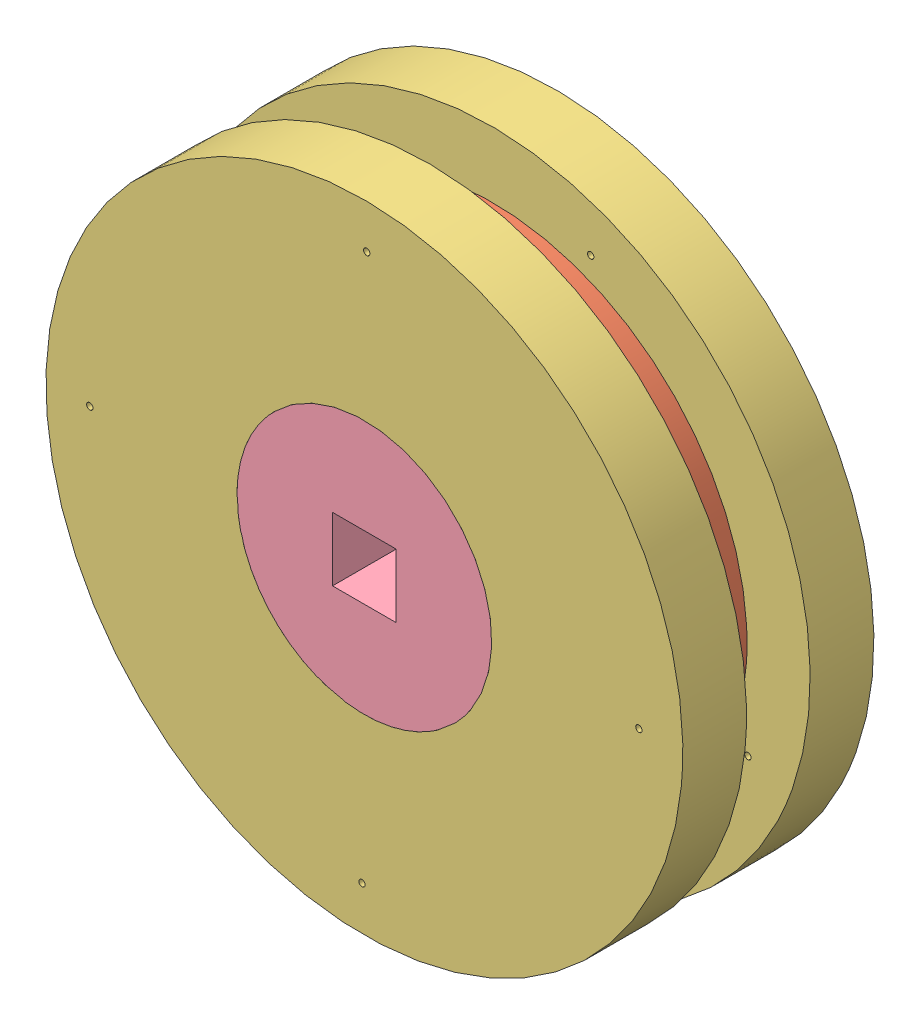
SolidWorks assembly MusicBoxCrank_assem.SLDASM, configuration Default (file format 4700). Lengths in mm.
Overall size (83.13 83.13 19.05).
9 component instances, 4 part files, 7 mates.
Components (placement in the parent):
- catchpeg_musicboxcrank-5: catchpeg_musicboxcrank.SLDPRT [Default] at (-4.9075 1.7278 -1.7592) size (10.84 6.03 6.35)
- Outer_ring_musicboxcrank-1: Outer_ring_musicboxcrank.SLDPRT [Default] at (-4.854 1.5337 -1.7592) size (50.8 50.8 6.35)
- catchpeg_musicboxcrank-2: catchpeg_musicboxcrank.SLDPRT [Default] at (-5.2855 3.0995 -1.7592) x (-0.5 0.866025 0) z (0 0 1) size (10.84 6.03 6.35)
- catchpeg_musicboxcrank-3: catchpeg_musicboxcrank.SLDPRT [Default] at (-5.9284 0.6924 -1.7592) x (-0.5 -0.866025 0) z (0 0 1) size (10.84 6.03 6.35)
- catchpeg_musicboxcrank-4: catchpeg_musicboxcrank.SLDPRT [Default] at (-3.5674 1.3789 -1.7592) size (10.84 6.03 6.35)
- plate-1: plate.SLDPRT [Default] at (3.3361 -1.7577 4.5908) x (0.999302 -0.037368 0) z (0 0 1) size (63.5 63.5 6.35)
- plate-2: plate.SLDPRT [Default] at (1.5791 -4.4389 -8.1092) x (0.922037 -0.387101 0) z (0 0 1) size (63.5 63.5 6.35)
- plateinner-1: plateinner.SLDPRT [Default] at (-4.9075 1.7278 -8.1092) size (25.4 25.4 6.35)
- plateinner-2: plateinner.SLDPRT [Default] at (-4.9075 1.7278 4.5908) size (25.4 25.4 6.35)
Mates (geometry in assembly coordinates):
- Coincident23: coincident anti-aligned: plane of Outer_ring_musicboxcrank-1 through (1.0495 -19.8887 4.5908) normal (-0.964063 -0.265674 0); plane of catchpeg_musicboxcrank-2 through (-1.9115 -9.1441 4.5908) normal (0.964063 0.265674 0)
- Concentric1: concentric aligned: circle of plate-1; circle of plateinner-2
- Coincident30: coincident aligned: plane of plate-1 through (-4.9075 1.7278 10.9408) normal (0 0 1); plane of plateinner-2 through (-4.9075 1.7278 10.9408) normal (0 0 1)
- Concentric3: concentric aligned: cylinder of plate-2 through (-4.9075 1.7278 -1.7592) axis (0 0 -1) radius 12.7; cylinder of plateinner-1 through (-4.9075 1.7278 -1.7592) axis (0 0 -1) radius 12.7
- Coincident33: coincident aligned: plane of plate-2 through (-4.9075 1.7278 -1.7592) normal (0 0 1); plane of plateinner-1 through (-4.9075 1.7278 -1.7592) normal (0 0 1)
- Coincident61: coincident anti-aligned: plane of Outer_ring_musicboxcrank-1 through (-4.854 1.5337 4.5908) normal (0 0 1); plane of plate-1 through (-4.9075 1.7278 4.5908) normal (0 0 -1)
- Coincident62: coincident anti-aligned: plane of Outer_ring_musicboxcrank-1 through (-4.854 1.5337 -1.7592) normal (0 0 -1); plane of plate-2 through (-4.9075 1.7278 -1.7592) normal (0 0 1)
